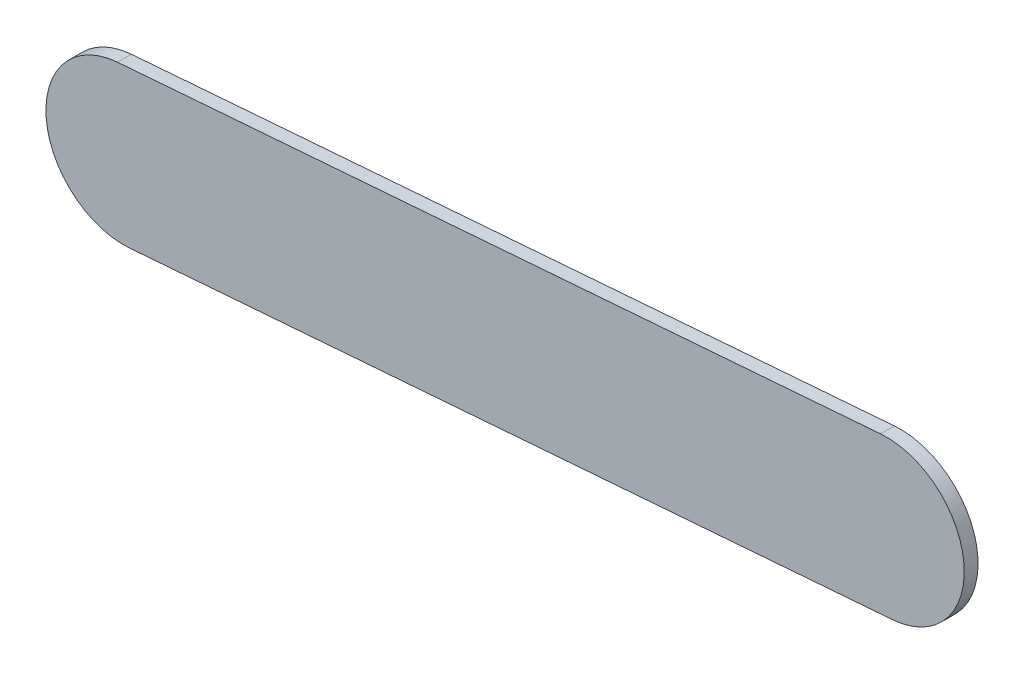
ISO-10303-21;
HEADER;
FILE_DESCRIPTION(('STEP AP214'),'2;1');
FILE_NAME('part.step','',(''),(''),'','','');
FILE_SCHEMA(('AUTOMOTIVE_DESIGN { 1 0 10303 214 1 1 1 1 }'));
ENDSEC;
DATA;
#1=APPLICATION_CONTEXT('core data for automotive mechanical design processes');
#2=APPLICATION_PROTOCOL_DEFINITION('international standard','automotive_design',2000,#1);
#3=PRODUCT_CONTEXT('',#1,'mechanical');
#4=PRODUCT('Part','Part','',(#3));
#5=PRODUCT_RELATED_PRODUCT_CATEGORY('part','',(#4));
#6=PRODUCT_DEFINITION_FORMATION('','',#4);
#7=PRODUCT_DEFINITION_CONTEXT('part definition',#1,'design');
#8=PRODUCT_DEFINITION('design','',#6,#7);
#9=PRODUCT_DEFINITION_SHAPE('','',#8);
#10=(LENGTH_UNIT() NAMED_UNIT(*) SI_UNIT(.MILLI.,.METRE.));
#11=(NAMED_UNIT(*) PLANE_ANGLE_UNIT() SI_UNIT($,.RADIAN.));
#12=(NAMED_UNIT(*) SI_UNIT($,.STERADIAN.) SOLID_ANGLE_UNIT());
#13=UNCERTAINTY_MEASURE_WITH_UNIT(LENGTH_MEASURE(1.E-05),#10,'distance_accuracy_value','');
#14=(GEOMETRIC_REPRESENTATION_CONTEXT(3) GLOBAL_UNCERTAINTY_ASSIGNED_CONTEXT((#13)) GLOBAL_UNIT_ASSIGNED_CONTEXT((#10,
#11,#12)) REPRESENTATION_CONTEXT('',''));
#15=CARTESIAN_POINT('',(0.,0.,0.));
#16=DIRECTION('',(0.,0.,1.));
#17=DIRECTION('',(1.,0.,0.));
#18=AXIS2_PLACEMENT_3D('',#15,#16,#17);
#19=CARTESIAN_POINT('',(75.2184875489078,3.7470027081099E-12,2.54));
#20=DIRECTION('',(0.,0.,-1.));
#21=DIRECTION('',(-1.,0.,0.));
#22=AXIS2_PLACEMENT_3D('',#19,#20,#21);
#23=CYLINDRICAL_SURFACE('',#22,14.2875000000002);
#24=CARTESIAN_POINT('',(75.2184875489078,3.7470027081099E-12,0.));
#25=DIRECTION('',(0.,0.,1.));
#26=DIRECTION('',(1.,0.,0.));
#27=AXIS2_PLACEMENT_3D('',#24,#25,#26);
#28=CIRCLE('',#27,14.2875000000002);
#29=CARTESIAN_POINT('',(76.3318845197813,-14.2440515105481,0.));
#30=VERTEX_POINT('',#29);
#31=CARTESIAN_POINT('',(74.1050905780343,14.2440515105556,0.));
#32=VERTEX_POINT('',#31);
#33=EDGE_CURVE('E96',#30,#32,#28,.T.);
#34=ORIENTED_EDGE('',*,*,#33,.T.);
#35=DIRECTION('',(0.,0.,-1.));
#36=VECTOR('',#35,1.);
#37=CARTESIAN_POINT('',(74.1050905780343,14.2440515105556,2.54));
#38=LINE('',#37,#36);
#39=CARTESIAN_POINT('',(74.1050905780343,14.2440515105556,2.54));
#40=VERTEX_POINT('',#39);
#41=EDGE_CURVE('E11',#40,#32,#38,.T.);
#42=ORIENTED_EDGE('',*,*,#41,.F.);
#43=CARTESIAN_POINT('',(75.2184875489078,3.7470027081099E-12,2.54));
#44=DIRECTION('',(0.,0.,1.));
#45=DIRECTION('',(1.,0.,0.));
#46=AXIS2_PLACEMENT_3D('',#43,#44,#45);
#47=CIRCLE('',#46,14.2875000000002);
#48=CARTESIAN_POINT('',(76.3318845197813,-14.2440515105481,2.54));
#49=VERTEX_POINT('',#48);
#50=EDGE_CURVE('E84',#49,#40,#47,.T.);
#51=ORIENTED_EDGE('',*,*,#50,.F.);
#52=DIRECTION('',(0.,0.,-1.));
#53=VECTOR('',#52,1.);
#54=CARTESIAN_POINT('',(76.3318845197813,-14.2440515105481,2.54));
#55=LINE('',#54,#53);
#56=EDGE_CURVE('E92',#49,#30,#55,.T.);
#57=ORIENTED_EDGE('',*,*,#56,.T.);
#58=EDGE_LOOP('',(#34,#42,#51,#57));
#59=FACE_BOUND('',#58,.T.);
#60=ADVANCED_FACE('F33',(#59),#23,.T.);
#61=CARTESIAN_POINT('',(-66.1829900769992,3.27832845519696,2.54));
#62=DIRECTION('',(0.077928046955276,-0.996958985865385,0.));
#63=DIRECTION('',(0.996958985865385,0.077928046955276,0.));
#64=AXIS2_PLACEMENT_3D('',#61,#62,#63);
#65=PLANE('',#64);
#66=DIRECTION('',(-0.996958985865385,-0.077928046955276,0.));
#67=VECTOR('',#66,1.);
#68=CARTESIAN_POINT('',(-66.1829900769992,3.27832845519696,0.));
#69=LINE('',#68,#67);
#70=CARTESIAN_POINT('',(-66.1829900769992,3.27832845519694,0.));
#71=VERTEX_POINT('',#70);
#72=EDGE_CURVE('E88',#32,#71,#69,.T.);
#73=ORIENTED_EDGE('',*,*,#72,.T.);
#74=DIRECTION('',(0.,0.,-1.));
#75=VECTOR('',#74,1.);
#76=CARTESIAN_POINT('',(-66.1829900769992,3.27832845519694,2.54));
#77=LINE('',#76,#75);
#78=CARTESIAN_POINT('',(-66.1829900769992,3.27832845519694,2.54));
#79=VERTEX_POINT('',#78);
#80=EDGE_CURVE('E41',#79,#71,#77,.T.);
#81=ORIENTED_EDGE('',*,*,#80,.F.);
#82=DIRECTION('',(-0.996958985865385,-0.077928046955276,0.));
#83=VECTOR('',#82,1.);
#84=CARTESIAN_POINT('',(-66.1829900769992,3.27832845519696,2.54));
#85=LINE('',#84,#83);
#86=EDGE_CURVE('E79',#40,#79,#85,.T.);
#87=ORIENTED_EDGE('',*,*,#86,.F.);
#88=ORIENTED_EDGE('',*,*,#41,.T.);
#89=EDGE_LOOP('',(#73,#81,#87,#88));
#90=FACE_BOUND('',#89,.T.);
#91=ADVANCED_FACE('F87',(#90),#65,.F.);
#92=CARTESIAN_POINT('',(-65.0695931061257,-10.9657230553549,2.54));
#93=DIRECTION('',(0.,0.,-1.));
#94=DIRECTION('',(-1.,0.,0.));
#95=AXIS2_PLACEMENT_3D('',#92,#93,#94);
#96=CYLINDRICAL_SURFACE('',#95,14.2875000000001);
#97=CARTESIAN_POINT('',(-65.0695931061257,-10.9657230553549,0.));
#98=DIRECTION('',(0.,0.,1.));
#99=DIRECTION('',(1.,0.,0.));
#100=AXIS2_PLACEMENT_3D('',#97,#98,#99);
#101=CIRCLE('',#100,14.2875000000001);
#102=CARTESIAN_POINT('',(-63.9561961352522,-25.2097745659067,0.));
#103=VERTEX_POINT('',#102);
#104=EDGE_CURVE('E66',#71,#103,#101,.T.);
#105=ORIENTED_EDGE('',*,*,#104,.T.);
#106=DIRECTION('',(0.,0.,-1.));
#107=VECTOR('',#106,1.);
#108=CARTESIAN_POINT('',(-63.9561961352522,-25.2097745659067,2.54));
#109=LINE('',#108,#107);
#110=CARTESIAN_POINT('',(-63.9561961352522,-25.2097745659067,2.54));
#111=VERTEX_POINT('',#110);
#112=EDGE_CURVE('E89',#111,#103,#109,.T.);
#113=ORIENTED_EDGE('',*,*,#112,.F.);
#114=CARTESIAN_POINT('',(-65.0695931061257,-10.9657230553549,2.54));
#115=DIRECTION('',(0.,0.,1.));
#116=DIRECTION('',(1.,0.,0.));
#117=AXIS2_PLACEMENT_3D('',#114,#115,#116);
#118=CIRCLE('',#117,14.2875000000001);
#119=EDGE_CURVE('E82',#79,#111,#118,.T.);
#120=ORIENTED_EDGE('',*,*,#119,.F.);
#121=ORIENTED_EDGE('',*,*,#80,.T.);
#122=EDGE_LOOP('',(#105,#113,#120,#121));
#123=FACE_BOUND('',#122,.T.);
#124=ADVANCED_FACE('F90',(#123),#96,.T.);
#125=CARTESIAN_POINT('',(76.3318845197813,-14.2440515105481,2.54));
#126=DIRECTION('',(-0.0779280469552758,0.996958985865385,0.));
#127=DIRECTION('',(-0.996958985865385,-0.0779280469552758,0.));
#128=AXIS2_PLACEMENT_3D('',#125,#126,#127);
#129=PLANE('',#128);
#130=DIRECTION('',(0.996958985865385,0.0779280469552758,0.));
#131=VECTOR('',#130,1.);
#132=CARTESIAN_POINT('',(76.3318845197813,-14.2440515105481,0.));
#133=LINE('',#132,#131);
#134=EDGE_CURVE('E72',#103,#30,#133,.T.);
#135=ORIENTED_EDGE('',*,*,#134,.T.);
#136=ORIENTED_EDGE('',*,*,#56,.F.);
#137=DIRECTION('',(0.996958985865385,0.0779280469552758,0.));
#138=VECTOR('',#137,1.);
#139=CARTESIAN_POINT('',(76.3318845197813,-14.2440515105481,2.54));
#140=LINE('',#139,#138);
#141=EDGE_CURVE('E49',#111,#49,#140,.T.);
#142=ORIENTED_EDGE('',*,*,#141,.F.);
#143=ORIENTED_EDGE('',*,*,#112,.T.);
#144=EDGE_LOOP('',(#135,#136,#142,#143));
#145=FACE_BOUND('',#144,.T.);
#146=ADVANCED_FACE('F103',(#145),#129,.F.);
#147=CARTESIAN_POINT('',(75.2184875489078,3.7470027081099E-12,2.54));
#148=DIRECTION('',(0.,0.,1.));
#149=DIRECTION('',(1.,0.,0.));
#150=AXIS2_PLACEMENT_3D('',#147,#148,#149);
#151=PLANE('',#150);
#152=ORIENTED_EDGE('',*,*,#50,.T.);
#153=ORIENTED_EDGE('',*,*,#86,.T.);
#154=ORIENTED_EDGE('',*,*,#119,.T.);
#155=ORIENTED_EDGE('',*,*,#141,.T.);
#156=EDGE_LOOP('',(#152,#153,#154,#155));
#157=FACE_BOUND('',#156,.T.);
#158=ADVANCED_FACE('F80',(#157),#151,.T.);
#159=CARTESIAN_POINT('',(75.2184875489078,3.7470027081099E-12,0.));
#160=DIRECTION('',(0.,0.,1.));
#161=DIRECTION('',(1.,0.,0.));
#162=AXIS2_PLACEMENT_3D('',#159,#160,#161);
#163=PLANE('',#162);
#164=ORIENTED_EDGE('',*,*,#33,.F.);
#165=ORIENTED_EDGE('',*,*,#134,.F.);
#166=ORIENTED_EDGE('',*,*,#104,.F.);
#167=ORIENTED_EDGE('',*,*,#72,.F.);
#168=EDGE_LOOP('',(#164,#165,#166,#167));
#169=FACE_BOUND('',#168,.T.);
#170=ADVANCED_FACE('F106',(#169),#163,.F.);
#171=CLOSED_SHELL('',(#60,#91,#124,#146,#158,#170));
#172=MANIFOLD_SOLID_BREP('B2',#171);
#173=ADVANCED_BREP_SHAPE_REPRESENTATION('',(#18,#172),#14);
#174=SHAPE_DEFINITION_REPRESENTATION(#9,#173);
ENDSEC;
END-ISO-10303-21;
